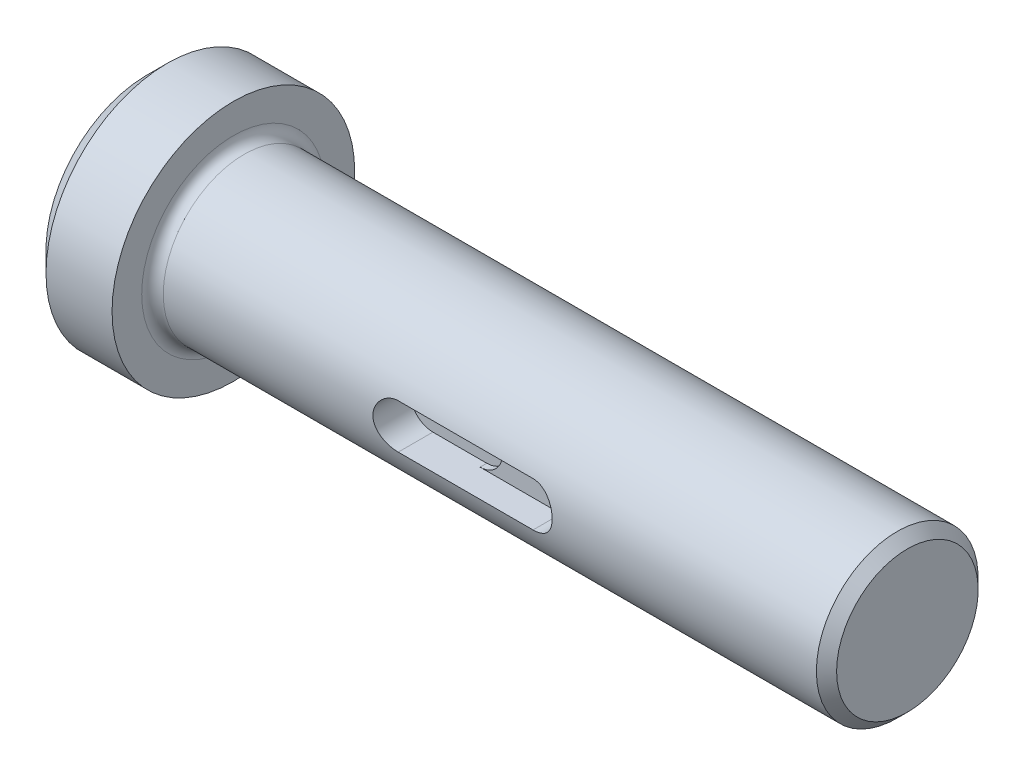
ISO-10303-21;
HEADER;
FILE_DESCRIPTION(('STEP AP214'),'2;1');
FILE_NAME('part.step','',(''),(''),'','','');
FILE_SCHEMA(('AUTOMOTIVE_DESIGN { 1 0 10303 214 1 1 1 1 }'));
ENDSEC;
DATA;
#1=APPLICATION_CONTEXT('core data for automotive mechanical design processes');
#2=APPLICATION_PROTOCOL_DEFINITION('international standard','automotive_design',2000,#1);
#3=PRODUCT_CONTEXT('',#1,'mechanical');
#4=PRODUCT('Part','Part','',(#3));
#5=PRODUCT_RELATED_PRODUCT_CATEGORY('part','',(#4));
#6=PRODUCT_DEFINITION_FORMATION('','',#4);
#7=PRODUCT_DEFINITION_CONTEXT('part definition',#1,'design');
#8=PRODUCT_DEFINITION('design','',#6,#7);
#9=PRODUCT_DEFINITION_SHAPE('','',#8);
#10=(LENGTH_UNIT() NAMED_UNIT(*) SI_UNIT(.MILLI.,.METRE.));
#11=(NAMED_UNIT(*) PLANE_ANGLE_UNIT() SI_UNIT($,.RADIAN.));
#12=(NAMED_UNIT(*) SI_UNIT($,.STERADIAN.) SOLID_ANGLE_UNIT());
#13=UNCERTAINTY_MEASURE_WITH_UNIT(LENGTH_MEASURE(1.E-05),#10,'distance_accuracy_value','');
#14=(GEOMETRIC_REPRESENTATION_CONTEXT(3) GLOBAL_UNCERTAINTY_ASSIGNED_CONTEXT((#13)) GLOBAL_UNIT_ASSIGNED_CONTEXT((#10,
#11,#12)) REPRESENTATION_CONTEXT('',''));
#15=CARTESIAN_POINT('',(0.,0.,0.));
#16=DIRECTION('',(0.,0.,1.));
#17=DIRECTION('',(1.,0.,0.));
#18=AXIS2_PLACEMENT_3D('',#15,#16,#17);
#19=CARTESIAN_POINT('',(7.20000000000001,0.,0.));
#20=DIRECTION('',(-1.,0.,0.));
#21=DIRECTION('',(0.,0.,1.));
#22=AXIS2_PLACEMENT_3D('',#19,#20,#21);
#23=TOROIDAL_SURFACE('',#22,6.8,0.8);
#24=CARTESIAN_POINT('',(6.40000000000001,0.,0.));
#25=DIRECTION('',(-1.,0.,0.));
#26=DIRECTION('',(0.,0.,1.));
#27=AXIS2_PLACEMENT_3D('',#24,#25,#26);
#28=CIRCLE('',#27,6.8);
#29=CARTESIAN_POINT('',(6.40000000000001,0.,6.8));
#30=VERTEX_POINT('',#29);
#31=EDGE_CURVE('E129',#30,#30,#28,.T.);
#32=ORIENTED_EDGE('',*,*,#31,.F.);
#33=EDGE_LOOP('',(#32));
#34=FACE_BOUND('',#33,.T.);
#35=CARTESIAN_POINT('',(7.20000000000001,0.,0.));
#36=DIRECTION('',(-1.,0.,0.));
#37=DIRECTION('',(0.,0.,1.));
#38=AXIS2_PLACEMENT_3D('',#35,#36,#37);
#39=CIRCLE('',#38,6.);
#40=CARTESIAN_POINT('',(7.20000000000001,0.,6.));
#41=VERTEX_POINT('',#40);
#42=EDGE_CURVE('E140',#41,#41,#39,.T.);
#43=ORIENTED_EDGE('',*,*,#42,.T.);
#44=EDGE_LOOP('',(#43));
#45=FACE_BOUND('',#44,.T.);
#46=ADVANCED_FACE('F37',(#34,#45),#23,.F.);
#47=CARTESIAN_POINT('',(-56.0675167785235,0.,0.));
#48=DIRECTION('',(-1.,0.,0.));
#49=DIRECTION('',(0.,0.,1.));
#50=AXIS2_PLACEMENT_3D('',#47,#48,#49);
#51=CYLINDRICAL_SURFACE('',#50,6.);
#52=CARTESIAN_POINT('',(55.65,0.,0.));
#53=DIRECTION('',(-1.,0.,0.));
#54=DIRECTION('',(0.,0.,1.));
#55=AXIS2_PLACEMENT_3D('',#52,#53,#54);
#56=CIRCLE('',#55,6.);
#57=CARTESIAN_POINT('',(55.65,0.,6.));
#58=VERTEX_POINT('',#57);
#59=EDGE_CURVE('E45',#58,#58,#56,.T.);
#60=ORIENTED_EDGE('',*,*,#59,.T.);
#61=EDGE_LOOP('',(#60));
#62=FACE_BOUND('',#61,.T.);
#63=DIRECTION('',(-1.,0.,0.));
#64=VECTOR('',#63,1.);
#65=CARTESIAN_POINT('',(-56.0675167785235,1.65,5.76866535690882));
#66=LINE('',#65,#64);
#67=CARTESIAN_POINT('',(24.4,1.65,5.76866535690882));
#68=VERTEX_POINT('',#67);
#69=CARTESIAN_POINT('',(34.4,1.65,5.76866535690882));
#70=VERTEX_POINT('',#69);
#71=EDGE_CURVE('E330',#68,#70,#66,.F.);
#72=ORIENTED_EDGE('',*,*,#71,.T.);
#73=CARTESIAN_POINT('',(34.4,1.65000000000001,5.76866535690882));
#74=CARTESIAN_POINT('',(34.4454788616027,1.65000073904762,5.76866190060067));
#75=CARTESIAN_POINT('',(34.4909350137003,1.64811850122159,5.7692038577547));
#76=CARTESIAN_POINT('',(34.581504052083,1.6406163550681,5.77134305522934));
#77=CARTESIAN_POINT('',(34.6266170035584,1.63499717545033,5.77294008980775));
#78=CARTESIAN_POINT('',(34.7607413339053,1.61262219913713,5.77924768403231));
#79=CARTESIAN_POINT('',(34.8488257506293,1.59034854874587,5.78547517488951));
#80=CARTESIAN_POINT('',(35.0198190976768,1.53182988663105,5.80124143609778));
#81=CARTESIAN_POINT('',(35.1027291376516,1.49558788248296,5.81077949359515));
#82=CARTESIAN_POINT('',(35.2613429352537,1.41021296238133,5.83208619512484));
#83=CARTESIAN_POINT('',(35.3370440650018,1.36107536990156,5.84385564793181));
#84=CARTESIAN_POINT('',(35.4810495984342,1.24992111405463,5.86864616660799));
#85=CARTESIAN_POINT('',(35.5491341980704,1.1876249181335,5.88169040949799));
#86=CARTESIAN_POINT('',(35.6740377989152,1.05251737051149,5.9073622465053));
#87=CARTESIAN_POINT('',(35.7308549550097,0.979704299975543,5.91998977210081));
#88=CARTESIAN_POINT('',(35.8325360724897,0.82408959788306,5.94366603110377));
#89=CARTESIAN_POINT('',(35.8771788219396,0.741138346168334,5.95468404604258));
#90=CARTESIAN_POINT('',(35.9517975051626,0.568557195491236,5.97363090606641));
#91=CARTESIAN_POINT('',(35.9817767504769,0.478928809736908,5.98156044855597));
#92=CARTESIAN_POINT('',(36.0255010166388,0.297843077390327,5.99327276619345));
#93=CARTESIAN_POINT('',(36.0396224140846,0.206482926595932,5.99715152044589));
#94=CARTESIAN_POINT('',(36.0524158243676,0.0226114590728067,6.00066143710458));
#95=CARTESIAN_POINT('',(36.0510902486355,-0.0698996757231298,6.00029326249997));
#96=CARTESIAN_POINT('',(36.0332888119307,-0.250818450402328,5.99542036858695));
#97=CARTESIAN_POINT('',(36.0172201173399,-0.339269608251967,5.99102682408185));
#98=CARTESIAN_POINT('',(35.9710483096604,-0.512167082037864,5.97872904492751));
#99=CARTESIAN_POINT('',(35.9409445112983,-0.596613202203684,5.97082463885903));
#100=CARTESIAN_POINT('',(35.8672535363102,-0.760127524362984,5.95223098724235));
#101=CARTESIAN_POINT('',(35.823529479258,-0.839130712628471,5.94151365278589));
#102=CARTESIAN_POINT('',(35.7239454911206,-0.988813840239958,5.91844497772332));
#103=CARTESIAN_POINT('',(35.66808328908,-1.05949221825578,5.90609333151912));
#104=CARTESIAN_POINT('',(35.5436663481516,-1.19294471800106,5.88061668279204));
#105=CARTESIAN_POINT('',(35.4747581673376,-1.25538738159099,5.86747959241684));
#106=CARTESIAN_POINT('',(35.3272948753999,-1.36792800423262,5.84226918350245));
#107=CARTESIAN_POINT('',(35.2487370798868,-1.4180225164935,5.8301961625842));
#108=CARTESIAN_POINT('',(35.0834357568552,-1.5047239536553,5.80842717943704));
#109=CARTESIAN_POINT('',(34.9966356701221,-1.54122774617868,5.79874957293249));
#110=CARTESIAN_POINT('',(34.8178456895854,-1.59896773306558,5.78309709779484));
#111=CARTESIAN_POINT('',(34.7258638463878,-1.62022694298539,5.77711664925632));
#112=CARTESIAN_POINT('',(34.5942114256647,-1.63899578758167,5.7718035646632));
#113=CARTESIAN_POINT('',(34.5554628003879,-1.64312255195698,5.770628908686));
#114=CARTESIAN_POINT('',(34.4778157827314,-1.64862183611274,5.76905994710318));
#115=CARTESIAN_POINT('',(34.4389177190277,-1.64999864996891,5.76866442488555));
#116=CARTESIAN_POINT('',(34.4,-1.65000000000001,5.76866535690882));
#117=B_SPLINE_CURVE_WITH_KNOTS('',3,(#73,#74,#75,#76,#77,#78,#79,#80,#81,#82,#83,#84,#85,#86,
#87,#88,#89,#90,#91,#92,#93,#94,#95,#96,#97,#98,#99,#100,#101,#102,#103,#104,#105,#106,#107,
#108,#109,#110,#111,#112,#113,#114,#115,#116),.UNSPECIFIED.,.F.,.F.,(4,2,2,2,2,2,2,2,2,2,2,2,2,
2,2,2,2,2,2,2,2,4),(0.,0.136349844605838,0.272673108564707,0.54446827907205,0.816204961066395,
1.08804032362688,1.36636714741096,1.64473951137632,1.9278760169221,2.21094855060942,
2.48715032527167,2.76330898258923,3.03206320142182,3.30083054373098,3.57239117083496,
3.84400264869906,4.12443966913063,4.40495488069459,4.68755735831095,4.96973227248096,
5.08660275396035,5.20329059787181),.UNSPECIFIED.);
#118=CARTESIAN_POINT('',(34.4,-1.65000000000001,5.76866535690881));
#119=VERTEX_POINT('',#118);
#120=EDGE_CURVE('E149',#70,#119,#117,.T.);
#121=ORIENTED_EDGE('',*,*,#120,.T.);
#122=DIRECTION('',(-1.,0.,0.));
#123=VECTOR('',#122,1.);
#124=CARTESIAN_POINT('',(-56.0675167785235,-1.65000000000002,5.76866535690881));
#125=LINE('',#124,#123);
#126=CARTESIAN_POINT('',(24.4,-1.65000000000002,5.76866535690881));
#127=VERTEX_POINT('',#126);
#128=EDGE_CURVE('E52',#119,#127,#125,.T.);
#129=ORIENTED_EDGE('',*,*,#128,.T.);
#130=CARTESIAN_POINT('',(24.4,-1.65000000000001,5.76866535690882));
#131=CARTESIAN_POINT('',(24.3545211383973,-1.65000073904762,5.76866190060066));
#132=CARTESIAN_POINT('',(24.3090649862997,-1.6481185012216,5.76920385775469));
#133=CARTESIAN_POINT('',(24.218495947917,-1.64061635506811,5.77134305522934));
#134=CARTESIAN_POINT('',(24.1733829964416,-1.63499717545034,5.77294008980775));
#135=CARTESIAN_POINT('',(24.0392586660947,-1.61262219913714,5.77924768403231));
#136=CARTESIAN_POINT('',(23.9511742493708,-1.59034854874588,5.78547517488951));
#137=CARTESIAN_POINT('',(23.7801809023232,-1.53182988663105,5.80124143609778));
#138=CARTESIAN_POINT('',(23.6972708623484,-1.49558788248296,5.81077949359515));
#139=CARTESIAN_POINT('',(23.5386570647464,-1.41021296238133,5.83208619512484));
#140=CARTESIAN_POINT('',(23.4629559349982,-1.36107536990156,5.84385564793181));
#141=CARTESIAN_POINT('',(23.3189504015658,-1.24992111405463,5.86864616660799));
#142=CARTESIAN_POINT('',(23.2508658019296,-1.1876249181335,5.88169040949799));
#143=CARTESIAN_POINT('',(23.1259622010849,-1.05251737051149,5.9073622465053));
#144=CARTESIAN_POINT('',(23.0691450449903,-0.979704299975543,5.91998977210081));
#145=CARTESIAN_POINT('',(22.9674639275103,-0.824089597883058,5.94366603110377));
#146=CARTESIAN_POINT('',(22.9228211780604,-0.741138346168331,5.95468404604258));
#147=CARTESIAN_POINT('',(22.8482024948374,-0.568557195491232,5.97363090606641));
#148=CARTESIAN_POINT('',(22.8182232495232,-0.478928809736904,5.98156044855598));
#149=CARTESIAN_POINT('',(22.7744989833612,-0.297843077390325,5.99327276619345));
#150=CARTESIAN_POINT('',(22.7603775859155,-0.206482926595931,5.99715152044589));
#151=CARTESIAN_POINT('',(22.7475841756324,-0.0226114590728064,6.00066143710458));
#152=CARTESIAN_POINT('',(22.7489097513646,0.0698996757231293,6.00029326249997));
#153=CARTESIAN_POINT('',(22.7667111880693,0.250818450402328,5.99542036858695));
#154=CARTESIAN_POINT('',(22.7827798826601,0.339269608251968,5.99102682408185));
#155=CARTESIAN_POINT('',(22.8289516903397,0.512167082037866,5.97872904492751));
#156=CARTESIAN_POINT('',(22.8590554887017,0.596613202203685,5.97082463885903));
#157=CARTESIAN_POINT('',(22.9327464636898,0.760127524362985,5.95223098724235));
#158=CARTESIAN_POINT('',(22.976470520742,0.839130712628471,5.94151365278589));
#159=CARTESIAN_POINT('',(23.0760545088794,0.988813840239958,5.91844497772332));
#160=CARTESIAN_POINT('',(23.13191671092,1.05949221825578,5.90609333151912));
#161=CARTESIAN_POINT('',(23.2563336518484,1.19294471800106,5.88061668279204));
#162=CARTESIAN_POINT('',(23.3252418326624,1.25538738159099,5.86747959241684));
#163=CARTESIAN_POINT('',(23.4727051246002,1.36792800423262,5.84226918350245));
#164=CARTESIAN_POINT('',(23.5512629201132,1.4180225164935,5.8301961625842));
#165=CARTESIAN_POINT('',(23.7165642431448,1.5047239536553,5.80842717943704));
#166=CARTESIAN_POINT('',(23.8033643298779,1.54122774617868,5.79874957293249));
#167=CARTESIAN_POINT('',(23.9821543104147,1.59896773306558,5.78309709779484));
#168=CARTESIAN_POINT('',(24.0741361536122,1.62022694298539,5.77711664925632));
#169=CARTESIAN_POINT('',(24.2057885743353,1.63899578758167,5.7718035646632));
#170=CARTESIAN_POINT('',(24.2445371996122,1.64312255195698,5.77062890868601));
#171=CARTESIAN_POINT('',(24.3221842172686,1.64862183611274,5.76905994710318));
#172=CARTESIAN_POINT('',(24.3610822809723,1.64999864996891,5.76866442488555));
#173=CARTESIAN_POINT('',(24.4,1.65000000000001,5.76866535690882));
#174=B_SPLINE_CURVE_WITH_KNOTS('',3,(#130,#131,#132,#133,#134,#135,#136,#137,#138,#139,#140,
#141,#142,#143,#144,#145,#146,#147,#148,#149,#150,#151,#152,#153,#154,#155,#156,#157,#158,#159,
#160,#161,#162,#163,#164,#165,#166,#167,#168,#169,#170,#171,#172,#173),.UNSPECIFIED.,.F.,.F.,(4,
2,2,2,2,2,2,2,2,2,2,2,2,2,2,2,2,2,2,2,2,4),(0.,0.136349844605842,0.272673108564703,
0.54446827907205,0.816204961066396,1.08804032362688,1.36636714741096,1.64473951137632,
1.92787601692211,2.21094855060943,2.48715032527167,2.76330898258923,3.03206320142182,
3.30083054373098,3.57239117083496,3.84400264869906,4.12443966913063,4.40495488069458,
4.68755735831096,4.96973227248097,5.08660275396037,5.20329059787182),.UNSPECIFIED.);
#175=EDGE_CURVE('E56',#127,#68,#174,.T.);
#176=ORIENTED_EDGE('',*,*,#175,.T.);
#177=EDGE_LOOP('',(#72,#121,#129,#176));
#178=FACE_BOUND('',#177,.T.);
#179=ORIENTED_EDGE('',*,*,#42,.F.);
#180=EDGE_LOOP('',(#179));
#181=FACE_BOUND('',#180,.T.);
#182=ADVANCED_FACE('F163',(#62,#178,#181),#51,.T.);
#183=CARTESIAN_POINT('',(56.4,6.,0.));
#184=DIRECTION('',(-1.,0.,0.));
#185=DIRECTION('',(0.,0.,1.));
#186=AXIS2_PLACEMENT_3D('',#183,#184,#185);
#187=PLANE('',#186);
#188=CARTESIAN_POINT('',(56.4,0.,0.));
#189=DIRECTION('',(-1.,0.,0.));
#190=DIRECTION('',(0.,0.,1.));
#191=AXIS2_PLACEMENT_3D('',#188,#189,#190);
#192=CIRCLE('',#191,5.25);
#193=CARTESIAN_POINT('',(56.4,0.,5.25));
#194=VERTEX_POINT('',#193);
#195=EDGE_CURVE('E11',#194,#194,#192,.F.);
#196=ORIENTED_EDGE('',*,*,#195,.T.);
#197=EDGE_LOOP('',(#196));
#198=FACE_BOUND('',#197,.T.);
#199=ADVANCED_FACE('F191',(#198),#187,.F.);
#200=CARTESIAN_POINT('',(0.,0.,0.));
#201=DIRECTION('',(1.,0.,0.));
#202=DIRECTION('',(0.,0.,-1.));
#203=AXIS2_PLACEMENT_3D('',#200,#201,#202);
#204=PLANE('',#203);
#205=CARTESIAN_POINT('',(0.,0.,0.));
#206=DIRECTION('',(1.,0.,0.));
#207=DIRECTION('',(0.,0.,-1.));
#208=AXIS2_PLACEMENT_3D('',#205,#206,#207);
#209=CIRCLE('',#208,7.50000000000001);
#210=CARTESIAN_POINT('',(0.,0.,-7.50000000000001));
#211=VERTEX_POINT('',#210);
#212=EDGE_CURVE('E143',#211,#211,#209,.F.);
#213=ORIENTED_EDGE('',*,*,#212,.T.);
#214=EDGE_LOOP('',(#213));
#215=FACE_BOUND('',#214,.T.);
#216=ADVANCED_FACE('F188',(#215),#204,.F.);
#217=CARTESIAN_POINT('',(-56.0675167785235,0.,0.));
#218=DIRECTION('',(-1.,0.,0.));
#219=DIRECTION('',(0.,0.,1.));
#220=AXIS2_PLACEMENT_3D('',#217,#218,#219);
#221=CYLINDRICAL_SURFACE('',#220,9.);
#222=CARTESIAN_POINT('',(1.5,0.,0.));
#223=DIRECTION('',(1.,0.,0.));
#224=DIRECTION('',(0.,0.,-1.));
#225=AXIS2_PLACEMENT_3D('',#222,#223,#224);
#226=CIRCLE('',#225,9.);
#227=CARTESIAN_POINT('',(1.5,0.,-9.));
#228=VERTEX_POINT('',#227);
#229=EDGE_CURVE('E146',#228,#228,#226,.T.);
#230=ORIENTED_EDGE('',*,*,#229,.T.);
#231=EDGE_LOOP('',(#230));
#232=FACE_BOUND('',#231,.T.);
#233=CARTESIAN_POINT('',(6.4,0.,0.));
#234=DIRECTION('',(-1.,0.,0.));
#235=DIRECTION('',(0.,0.,1.));
#236=AXIS2_PLACEMENT_3D('',#233,#234,#235);
#237=CIRCLE('',#236,9.);
#238=CARTESIAN_POINT('',(6.4,0.,9.));
#239=VERTEX_POINT('',#238);
#240=EDGE_CURVE('E137',#239,#239,#237,.T.);
#241=ORIENTED_EDGE('',*,*,#240,.T.);
#242=EDGE_LOOP('',(#241));
#243=FACE_BOUND('',#242,.T.);
#244=ADVANCED_FACE('F184',(#232,#243),#221,.T.);
#245=CARTESIAN_POINT('',(6.40000000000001,9.,0.));
#246=DIRECTION('',(-1.,0.,0.));
#247=DIRECTION('',(0.,0.,1.));
#248=AXIS2_PLACEMENT_3D('',#245,#246,#247);
#249=PLANE('',#248);
#250=ORIENTED_EDGE('',*,*,#240,.F.);
#251=EDGE_LOOP('',(#250));
#252=FACE_BOUND('',#251,.T.);
#253=ORIENTED_EDGE('',*,*,#31,.T.);
#254=EDGE_LOOP('',(#253));
#255=FACE_BOUND('',#254,.T.);
#256=ADVANCED_FACE('F181',(#252,#255),#249,.F.);
#257=CARTESIAN_POINT('',(0.,0.,0.));
#258=DIRECTION('',(1.,0.,0.));
#259=DIRECTION('',(0.,0.,-1.));
#260=AXIS2_PLACEMENT_3D('',#257,#258,#259);
#261=CONICAL_SURFACE('',#260,7.50000000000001,0.785398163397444);
#262=ORIENTED_EDGE('',*,*,#229,.F.);
#263=EDGE_LOOP('',(#262));
#264=FACE_BOUND('',#263,.T.);
#265=ORIENTED_EDGE('',*,*,#212,.F.);
#266=EDGE_LOOP('',(#265));
#267=FACE_BOUND('',#266,.T.);
#268=ADVANCED_FACE('F180',(#264,#267),#261,.T.);
#269=CARTESIAN_POINT('',(24.4,0.,3.7));
#270=DIRECTION('',(0.,0.,1.));
#271=DIRECTION('',(1.,0.,0.));
#272=AXIS2_PLACEMENT_3D('',#269,#270,#271);
#273=CYLINDRICAL_SURFACE('',#272,1.65000000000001);
#274=DIRECTION('',(0.,0.,1.));
#275=VECTOR('',#274,1.);
#276=CARTESIAN_POINT('',(24.4,-1.65000000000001,3.7));
#277=LINE('',#276,#275);
#278=CARTESIAN_POINT('',(24.4,-1.65000000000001,3.2));
#279=VERTEX_POINT('',#278);
#280=EDGE_CURVE('E88',#279,#127,#277,.T.);
#281=ORIENTED_EDGE('',*,*,#280,.F.);
#282=CARTESIAN_POINT('',(24.4,0.,3.2));
#283=DIRECTION('',(0.,0.,1.));
#284=DIRECTION('',(1.,0.,0.));
#285=AXIS2_PLACEMENT_3D('',#282,#283,#284);
#286=CIRCLE('',#285,1.65000000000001);
#287=CARTESIAN_POINT('',(24.4,1.65000000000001,3.2));
#288=VERTEX_POINT('',#287);
#289=EDGE_CURVE('E93',#288,#279,#286,.T.);
#290=ORIENTED_EDGE('',*,*,#289,.F.);
#291=DIRECTION('',(0.,0.,1.));
#292=VECTOR('',#291,1.);
#293=CARTESIAN_POINT('',(24.4,1.65,3.7));
#294=LINE('',#293,#292);
#295=EDGE_CURVE('E127',#288,#68,#294,.T.);
#296=ORIENTED_EDGE('',*,*,#295,.T.);
#297=ORIENTED_EDGE('',*,*,#175,.F.);
#298=EDGE_LOOP('',(#281,#290,#296,#297));
#299=FACE_BOUND('',#298,.T.);
#300=ADVANCED_FACE('F90',(#299),#273,.F.);
#301=CARTESIAN_POINT('',(24.4,1.65,3.7));
#302=DIRECTION('',(0.,1.,0.));
#303=DIRECTION('',(0.,0.,1.));
#304=AXIS2_PLACEMENT_3D('',#301,#302,#303);
#305=PLANE('',#304);
#306=ORIENTED_EDGE('',*,*,#295,.F.);
#307=DIRECTION('',(-1.,0.,0.));
#308=VECTOR('',#307,1.);
#309=CARTESIAN_POINT('',(24.4,1.65000000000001,3.2));
#310=LINE('',#309,#308);
#311=CARTESIAN_POINT('',(28.4,1.65,3.2));
#312=VERTEX_POINT('',#311);
#313=EDGE_CURVE('E111',#312,#288,#310,.T.);
#314=ORIENTED_EDGE('',*,*,#313,.F.);
#315=DIRECTION('',(0.,0.,1.));
#316=VECTOR('',#315,1.);
#317=CARTESIAN_POINT('',(28.4,1.65,3.2));
#318=LINE('',#317,#316);
#319=CARTESIAN_POINT('',(28.4,1.65,3.7));
#320=VERTEX_POINT('',#319);
#321=EDGE_CURVE('E116',#312,#320,#318,.T.);
#322=ORIENTED_EDGE('',*,*,#321,.T.);
#323=DIRECTION('',(-1.,0.,0.));
#324=VECTOR('',#323,1.);
#325=CARTESIAN_POINT('',(24.4,1.65,3.7));
#326=LINE('',#325,#324);
#327=CARTESIAN_POINT('',(34.4,1.65,3.7));
#328=VERTEX_POINT('',#327);
#329=EDGE_CURVE('E97',#328,#320,#326,.T.);
#330=ORIENTED_EDGE('',*,*,#329,.F.);
#331=DIRECTION('',(0.,0.,1.));
#332=VECTOR('',#331,1.);
#333=CARTESIAN_POINT('',(34.4,1.65,3.7));
#334=LINE('',#333,#332);
#335=EDGE_CURVE('E130',#328,#70,#334,.T.);
#336=ORIENTED_EDGE('',*,*,#335,.T.);
#337=ORIENTED_EDGE('',*,*,#71,.F.);
#338=EDGE_LOOP('',(#306,#314,#322,#330,#336,#337));
#339=FACE_BOUND('',#338,.T.);
#340=ADVANCED_FACE('F172',(#339),#305,.F.);
#341=CARTESIAN_POINT('',(34.4,0.,3.7));
#342=DIRECTION('',(0.,0.,1.));
#343=DIRECTION('',(1.,0.,0.));
#344=AXIS2_PLACEMENT_3D('',#341,#342,#343);
#345=CYLINDRICAL_SURFACE('',#344,1.65000000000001);
#346=ORIENTED_EDGE('',*,*,#335,.F.);
#347=CARTESIAN_POINT('',(34.4,0.,3.7));
#348=DIRECTION('',(0.,0.,1.));
#349=DIRECTION('',(-1.,0.,0.));
#350=AXIS2_PLACEMENT_3D('',#347,#348,#349);
#351=CIRCLE('',#350,1.65000000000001);
#352=CARTESIAN_POINT('',(34.4,-1.65000000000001,3.7));
#353=VERTEX_POINT('',#352);
#354=EDGE_CURVE('E122',#353,#328,#351,.T.);
#355=ORIENTED_EDGE('',*,*,#354,.F.);
#356=DIRECTION('',(0.,0.,1.));
#357=VECTOR('',#356,1.);
#358=CARTESIAN_POINT('',(34.4,-1.65000000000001,3.7));
#359=LINE('',#358,#357);
#360=EDGE_CURVE('E96',#353,#119,#359,.T.);
#361=ORIENTED_EDGE('',*,*,#360,.T.);
#362=ORIENTED_EDGE('',*,*,#120,.F.);
#363=EDGE_LOOP('',(#346,#355,#361,#362));
#364=FACE_BOUND('',#363,.T.);
#365=ADVANCED_FACE('F167',(#364),#345,.F.);
#366=CARTESIAN_POINT('',(34.4,-1.65000000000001,3.7));
#367=DIRECTION('',(0.,-1.,0.));
#368=DIRECTION('',(1.,0.,0.));
#369=AXIS2_PLACEMENT_3D('',#366,#367,#368);
#370=PLANE('',#369);
#371=DIRECTION('',(1.,0.,0.));
#372=VECTOR('',#371,1.);
#373=CARTESIAN_POINT('',(34.4,-1.65000000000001,3.7));
#374=LINE('',#373,#372);
#375=CARTESIAN_POINT('',(28.4,-1.65000000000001,3.7));
#376=VERTEX_POINT('',#375);
#377=EDGE_CURVE('E119',#376,#353,#374,.T.);
#378=ORIENTED_EDGE('',*,*,#377,.F.);
#379=DIRECTION('',(0.,0.,1.));
#380=VECTOR('',#379,1.);
#381=CARTESIAN_POINT('',(28.4,-1.65000000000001,3.2));
#382=LINE('',#381,#380);
#383=CARTESIAN_POINT('',(28.4,-1.65000000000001,3.2));
#384=VERTEX_POINT('',#383);
#385=EDGE_CURVE('E103',#384,#376,#382,.T.);
#386=ORIENTED_EDGE('',*,*,#385,.F.);
#387=DIRECTION('',(1.,0.,0.));
#388=VECTOR('',#387,1.);
#389=CARTESIAN_POINT('',(28.4,-1.65000000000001,3.2));
#390=LINE('',#389,#388);
#391=EDGE_CURVE('E100',#279,#384,#390,.T.);
#392=ORIENTED_EDGE('',*,*,#391,.F.);
#393=ORIENTED_EDGE('',*,*,#280,.T.);
#394=ORIENTED_EDGE('',*,*,#128,.F.);
#395=ORIENTED_EDGE('',*,*,#360,.F.);
#396=EDGE_LOOP('',(#378,#386,#392,#393,#394,#395));
#397=FACE_BOUND('',#396,.T.);
#398=ADVANCED_FACE('F102',(#397),#370,.F.);
#399=CARTESIAN_POINT('',(24.4,0.,3.7));
#400=DIRECTION('',(0.,0.,-1.));
#401=DIRECTION('',(-1.,0.,0.));
#402=AXIS2_PLACEMENT_3D('',#399,#400,#401);
#403=PLANE('',#402);
#404=ORIENTED_EDGE('',*,*,#329,.T.);
#405=CARTESIAN_POINT('',(28.4,0.,3.7));
#406=DIRECTION('',(0.,0.,-1.));
#407=DIRECTION('',(-1.,0.,0.));
#408=AXIS2_PLACEMENT_3D('',#405,#406,#407);
#409=CIRCLE('',#408,1.65000000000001);
#410=EDGE_CURVE('E328',#320,#376,#409,.T.);
#411=ORIENTED_EDGE('',*,*,#410,.T.);
#412=ORIENTED_EDGE('',*,*,#377,.T.);
#413=ORIENTED_EDGE('',*,*,#354,.T.);
#414=EDGE_LOOP('',(#404,#411,#412,#413));
#415=FACE_BOUND('',#414,.T.);
#416=ADVANCED_FACE('F176',(#415),#403,.F.);
#417=CARTESIAN_POINT('',(28.4,0.,3.2));
#418=DIRECTION('',(0.,0.,1.));
#419=DIRECTION('',(1.,0.,0.));
#420=AXIS2_PLACEMENT_3D('',#417,#418,#419);
#421=CYLINDRICAL_SURFACE('',#420,1.65000000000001);
#422=ORIENTED_EDGE('',*,*,#321,.F.);
#423=CARTESIAN_POINT('',(28.4,0.,3.2));
#424=DIRECTION('',(0.,0.,1.));
#425=DIRECTION('',(1.,0.,0.));
#426=AXIS2_PLACEMENT_3D('',#423,#424,#425);
#427=CIRCLE('',#426,1.65000000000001);
#428=EDGE_CURVE('E107',#384,#312,#427,.T.);
#429=ORIENTED_EDGE('',*,*,#428,.F.);
#430=ORIENTED_EDGE('',*,*,#385,.T.);
#431=ORIENTED_EDGE('',*,*,#410,.F.);
#432=EDGE_LOOP('',(#422,#429,#430,#431));
#433=FACE_BOUND('',#432,.T.);
#434=ADVANCED_FACE('F242',(#433),#421,.F.);
#435=CARTESIAN_POINT('',(24.4,0.,3.2));
#436=DIRECTION('',(0.,0.,1.));
#437=DIRECTION('',(1.,0.,0.));
#438=AXIS2_PLACEMENT_3D('',#435,#436,#437);
#439=PLANE('',#438);
#440=ORIENTED_EDGE('',*,*,#289,.T.);
#441=ORIENTED_EDGE('',*,*,#391,.T.);
#442=ORIENTED_EDGE('',*,*,#428,.T.);
#443=ORIENTED_EDGE('',*,*,#313,.T.);
#444=EDGE_LOOP('',(#440,#441,#442,#443));
#445=FACE_BOUND('',#444,.T.);
#446=ADVANCED_FACE('F109',(#445),#439,.T.);
#447=CARTESIAN_POINT('',(55.65,0.,0.));
#448=DIRECTION('',(-1.,0.,0.));
#449=DIRECTION('',(0.,0.,1.));
#450=AXIS2_PLACEMENT_3D('',#447,#448,#449);
#451=CONICAL_SURFACE('',#450,6.,0.785398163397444);
#452=ORIENTED_EDGE('',*,*,#195,.F.);
#453=EDGE_LOOP('',(#452));
#454=FACE_BOUND('',#453,.T.);
#455=ORIENTED_EDGE('',*,*,#59,.F.);
#456=EDGE_LOOP('',(#455));
#457=FACE_BOUND('',#456,.T.);
#458=ADVANCED_FACE('F39',(#454,#457),#451,.T.);
#459=CLOSED_SHELL('',(#46,#182,#199,#216,#244,#256,#268,#300,#340,#365,#398,#416,#434,#446,#458));
#460=MANIFOLD_SOLID_BREP('B2',#459);
#461=ADVANCED_BREP_SHAPE_REPRESENTATION('',(#18,#460),#14);
#462=SHAPE_DEFINITION_REPRESENTATION(#9,#461);
ENDSEC;
END-ISO-10303-21;
